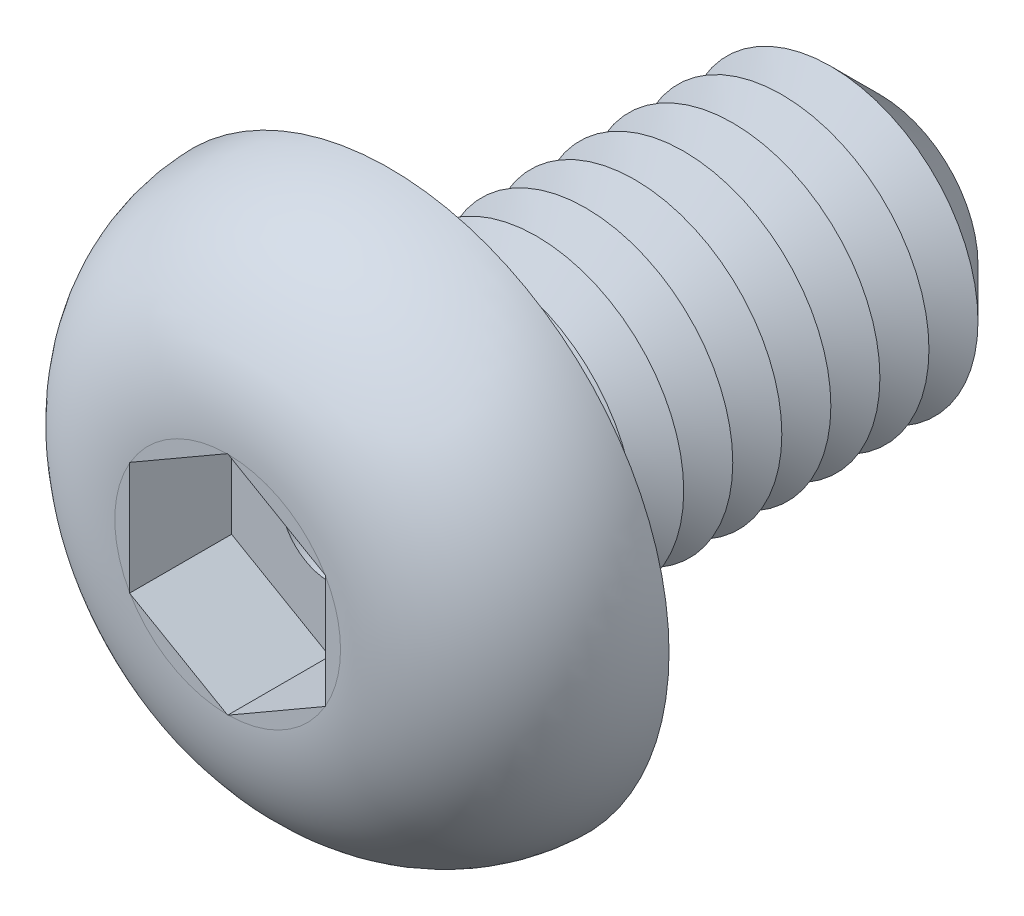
from build123d import *

# Parameters (mm, degrees)
CUT_EXTRUDE1_DEPTH  = 1.04
SKETCH4_R           = 1.5
BOSS_EXTRUDE1_DEPTH = 5
CHAMFER1_SIZE       = 0.5
LPATTERN1_COUNT     = 8
LPATTERN1_PITCH     = 0.5
FILLET2_R           = 0.25
SKETCH6_R           = 0.5
CUT_EXTRUDE2_DEPTH  = 5.61


with BuildPart() as part:
    # Sketch2 → Revolve1 (revolve)
    with BuildSketch(Plane(origin=(0, 0, 0), x_dir=(0, 0, -1), z_dir=(1, 0, 0)), mode=Mode.PRIVATE) as revolve1_sk:
        with BuildLine():
            Line((0, 0), (-1.65, 0))
            Line((-1.65, 0), (-1.65, 1.150735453))
            ThreePointArc((-1.65, 1.150735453), (-1.169631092, 2.335007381), (0, 2.85))
            Line((0, 2.85), (0, 0))
        make_face()
    revolve(revolve1_sk.sketch.rotate(Axis((0, 0, 47.934239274), (0, 0, -1)), 90), axis=Axis((0, 0, 47.934239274), (0, 0, -1)))

    # Sketch3 → Cut-Extrude1 (cut)
    with BuildSketch(Plane.XY.offset(1.65)):
        Polygon((0, 1.154700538), (-1, 0.577350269), (-1, -0.577350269), (0, -1.154700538), (1, -0.577350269), (1, 0.577350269), align=None)
    extrude(amount=-CUT_EXTRUDE1_DEPTH, mode=Mode.SUBTRACT)


with BuildPart() as cut_extrude1_kept_piece:
    # of the separate pieces the step leaves, the one the design keeps (cut_extrude1_pieces_kept)
    add(part.part.solids().sort_by_distance((2.85, 0, 0))[0])

    # Sketch4 → Boss-Extrude1 (add)
    with BuildSketch(Plane(origin=(0, 0, 0), x_dir=(-1, 0, 0), z_dir=(0, 0, -1))):
        with Locations(Location((0, 0, 0), (0, 0, 180))):
            Circle(SKETCH4_R)
    extrude(amount=BOSS_EXTRUDE1_DEPTH)

    # Chamfer1
    chamfer1_edges = [cut_extrude1_kept_piece.edges().sort_by_distance(p)[0] for p in [
        (-1.5, 0, -5),
    ]]
    chamfer(chamfer1_edges, length=CHAMFER1_SIZE)

    # Sketch5 → Cut-Revolve1 (revolve, cut)
    with BuildSketch(Plane(origin=(0, 0, 0), x_dir=(0, 0, -1), z_dir=(1, 0, 0)), mode=Mode.PRIVATE) as cut_revolve1_sk:
        Polygon((0.5, 1.5), (1, 1.5), (0.75, 1.066987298), align=None)
    cut_revolve1 = revolve(cut_revolve1_sk.sketch.rotate(Axis((0, 0, 47.934239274), (0, 0, -1)), 90), axis=Axis((0, 0, 47.934239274), (0, 0, -1)), mode=Mode.SUBTRACT)

    # LPattern1: Cut-Revolve1 ×8
    with Locations(*[(0, 0, -i * LPATTERN1_PITCH) for i in range(1, LPATTERN1_COUNT)]):
        add(cut_revolve1, mode=Mode.SUBTRACT)

    # Fillet2
    fillet2_edges = [cut_extrude1_kept_piece.edges().sort_by_distance(p)[0] for p in [
        (-1.5, 0, 0),
    ]]
    fillet(fillet2_edges, radius=FILLET2_R)

    # Sketch6 → Cut-Extrude2 (cut)
    with BuildSketch(Plane.XY.offset(0.61)):
        Circle(SKETCH6_R)
    extrude(amount=-CUT_EXTRUDE2_DEPTH, mode=Mode.SUBTRACT)


solid = cut_extrude1_kept_piece.part
